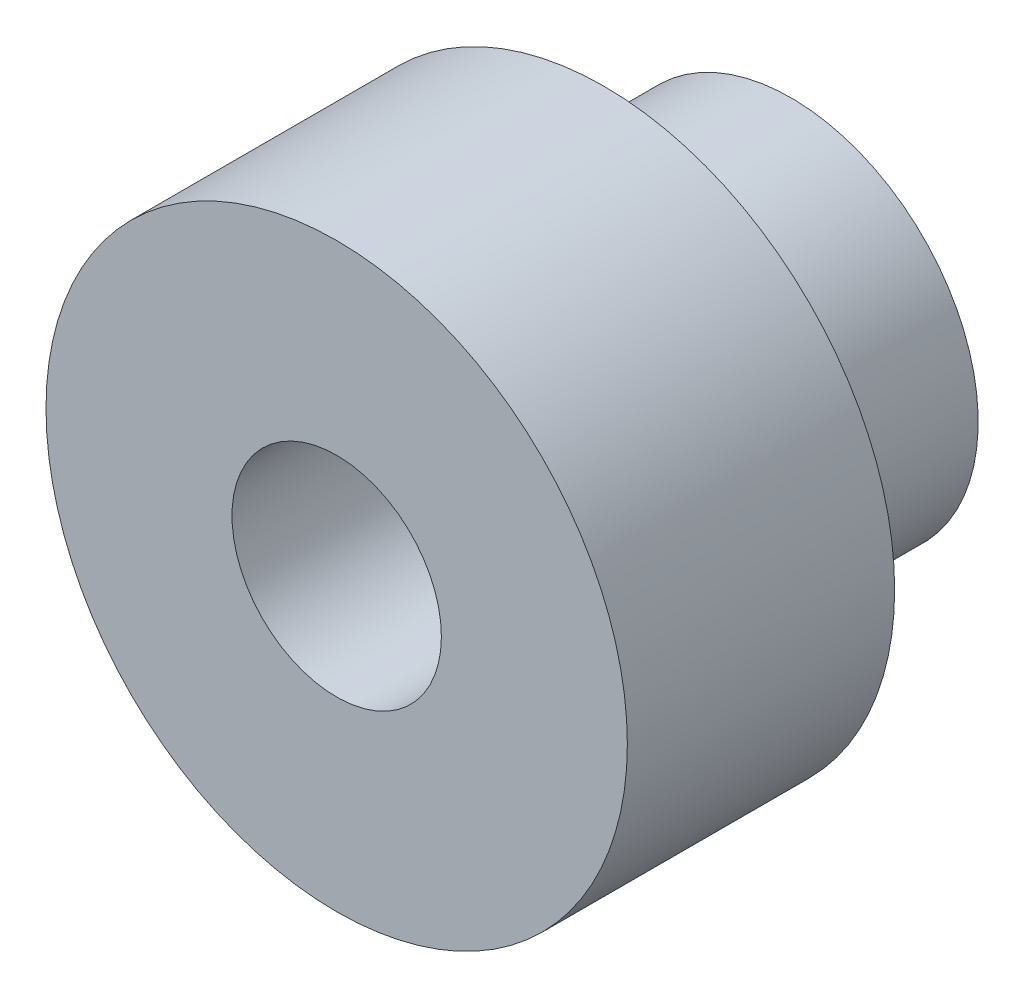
ISO-10303-21;
HEADER;
FILE_DESCRIPTION(('STEP AP214'),'2;1');
FILE_NAME('part.step','',(''),(''),'','','');
FILE_SCHEMA(('AUTOMOTIVE_DESIGN { 1 0 10303 214 1 1 1 1 }'));
ENDSEC;
DATA;
#1=APPLICATION_CONTEXT('core data for automotive mechanical design processes');
#2=APPLICATION_PROTOCOL_DEFINITION('international standard','automotive_design',2000,#1);
#3=PRODUCT_CONTEXT('',#1,'mechanical');
#4=PRODUCT('Part','Part','',(#3));
#5=PRODUCT_RELATED_PRODUCT_CATEGORY('part','',(#4));
#6=PRODUCT_DEFINITION_FORMATION('','',#4);
#7=PRODUCT_DEFINITION_CONTEXT('part definition',#1,'design');
#8=PRODUCT_DEFINITION('design','',#6,#7);
#9=PRODUCT_DEFINITION_SHAPE('','',#8);
#10=(LENGTH_UNIT() NAMED_UNIT(*) SI_UNIT(.MILLI.,.METRE.));
#11=(NAMED_UNIT(*) PLANE_ANGLE_UNIT() SI_UNIT($,.RADIAN.));
#12=(NAMED_UNIT(*) SI_UNIT($,.STERADIAN.) SOLID_ANGLE_UNIT());
#13=UNCERTAINTY_MEASURE_WITH_UNIT(LENGTH_MEASURE(1.E-05),#10,'distance_accuracy_value','');
#14=(GEOMETRIC_REPRESENTATION_CONTEXT(3) GLOBAL_UNCERTAINTY_ASSIGNED_CONTEXT((#13)) GLOBAL_UNIT_ASSIGNED_CONTEXT((#10,
#11,#12)) REPRESENTATION_CONTEXT('',''));
#15=CARTESIAN_POINT('',(0.,0.,0.));
#16=DIRECTION('',(0.,0.,1.));
#17=DIRECTION('',(1.,0.,0.));
#18=AXIS2_PLACEMENT_3D('',#15,#16,#17);
#19=CARTESIAN_POINT('',(0.,0.,-3.628869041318));
#20=DIRECTION('',(0.,0.,-1.));
#21=DIRECTION('',(1.,0.,0.));
#22=AXIS2_PLACEMENT_3D('',#19,#20,#21);
#23=CYLINDRICAL_SURFACE('',#22,0.7835);
#24=CARTESIAN_POINT('',(0.7835,0.,3.4));
#25=CARTESIAN_POINT('',(0.7835,0.,0.));
#26=(BOUNDED_CURVE() B_SPLINE_CURVE(1,(#24,#25),.UNSPECIFIED.,.F.,
.F.) B_SPLINE_CURVE_WITH_KNOTS((2,2),(-7.028869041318,-3.628869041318),
.UNSPECIFIED.) CURVE() GEOMETRIC_REPRESENTATION_ITEM() RATIONAL_B_SPLINE_CURVE((1.,1.)) REPRESENTATION_ITEM(''));
#27=CARTESIAN_POINT('',(0.7835,0.,3.4));
#28=VERTEX_POINT('',#27);
#29=CARTESIAN_POINT('',(0.7835,0.,0.));
#30=VERTEX_POINT('',#29);
#31=EDGE_CURVE('E11',#28,#30,#26,.T.);
#32=ORIENTED_EDGE('',*,*,#31,.F.);
#33=CARTESIAN_POINT('',(0.,0.,3.4));
#34=DIRECTION('',(0.,0.,1.));
#35=DIRECTION('',(1.,0.,0.));
#36=AXIS2_PLACEMENT_3D('',#33,#34,#35);
#37=CIRCLE('',#36,0.7835);
#38=EDGE_CURVE('E62',#28,#28,#37,.T.);
#39=ORIENTED_EDGE('',*,*,#38,.T.);
#40=ORIENTED_EDGE('',*,*,#31,.T.);
#41=CARTESIAN_POINT('',(0.,0.,0.));
#42=DIRECTION('',(0.,0.,1.));
#43=DIRECTION('',(1.,0.,0.));
#44=AXIS2_PLACEMENT_3D('',#41,#42,#43);
#45=CIRCLE('',#44,0.7835);
#46=EDGE_CURVE('E64',#30,#30,#45,.T.);
#47=ORIENTED_EDGE('',*,*,#46,.F.);
#48=EDGE_LOOP('',(#32,#39,#40,#47));
#49=FACE_BOUND('',#48,.T.);
#50=ADVANCED_FACE('F17',(#49),#23,.F.);
#51=CARTESIAN_POINT('',(0.,0.,0.));
#52=DIRECTION('',(0.,0.,1.));
#53=DIRECTION('',(-1.,0.,0.));
#54=AXIS2_PLACEMENT_3D('',#51,#52,#53);
#55=CYLINDRICAL_SURFACE('',#54,1.4);
#56=CARTESIAN_POINT('',(0.,0.,0.));
#57=DIRECTION('',(0.,0.,-1.));
#58=DIRECTION('',(-1.,0.,0.));
#59=AXIS2_PLACEMENT_3D('',#56,#57,#58);
#60=CIRCLE('',#59,1.4);
#61=CARTESIAN_POINT('',(-1.4,0.,0.));
#62=VERTEX_POINT('',#61);
#63=EDGE_CURVE('E68',#62,#62,#60,.T.);
#64=ORIENTED_EDGE('',*,*,#63,.F.);
#65=CARTESIAN_POINT('',(-1.4,0.,0.));
#66=CARTESIAN_POINT('',(-1.4,0.,1.4));
#67=(BOUNDED_CURVE() B_SPLINE_CURVE(1,(#65,#66),.UNSPECIFIED.,.F.,
.F.) B_SPLINE_CURVE_WITH_KNOTS((2,2),(0.,1.4),
.UNSPECIFIED.) CURVE() GEOMETRIC_REPRESENTATION_ITEM() RATIONAL_B_SPLINE_CURVE((1.,1.)) REPRESENTATION_ITEM(''));
#68=CARTESIAN_POINT('',(-1.4,0.,1.4));
#69=VERTEX_POINT('',#68);
#70=EDGE_CURVE('E27',#62,#69,#67,.T.);
#71=ORIENTED_EDGE('',*,*,#70,.T.);
#72=CARTESIAN_POINT('',(0.,0.,1.4));
#73=DIRECTION('',(0.,0.,-1.));
#74=DIRECTION('',(-1.,0.,0.));
#75=AXIS2_PLACEMENT_3D('',#72,#73,#74);
#76=CIRCLE('',#75,1.4);
#77=EDGE_CURVE('E75',#69,#69,#76,.T.);
#78=ORIENTED_EDGE('',*,*,#77,.T.);
#79=ORIENTED_EDGE('',*,*,#70,.F.);
#80=EDGE_LOOP('',(#64,#71,#78,#79));
#81=FACE_BOUND('',#80,.T.);
#82=ADVANCED_FACE('F91',(#81),#55,.T.);
#83=CARTESIAN_POINT('',(-2.175,0.,1.4));
#84=DIRECTION('',(0.,0.,1.));
#85=DIRECTION('',(1.,0.,0.));
#86=AXIS2_PLACEMENT_3D('',#83,#84,#85);
#87=PLANE('',#86);
#88=CARTESIAN_POINT('',(0.,0.,1.4));
#89=DIRECTION('',(0.,0.,-1.));
#90=DIRECTION('',(-1.,0.,0.));
#91=AXIS2_PLACEMENT_3D('',#88,#89,#90);
#92=CIRCLE('',#91,2.175);
#93=CARTESIAN_POINT('',(-2.175,0.,1.4));
#94=VERTEX_POINT('',#93);
#95=EDGE_CURVE('E77',#94,#94,#92,.T.);
#96=ORIENTED_EDGE('',*,*,#95,.T.);
#97=EDGE_LOOP('',(#96));
#98=FACE_BOUND('',#97,.T.);
#99=ORIENTED_EDGE('',*,*,#77,.F.);
#100=EDGE_LOOP('',(#99));
#101=FACE_BOUND('',#100,.T.);
#102=ADVANCED_FACE('F93',(#98,#101),#87,.F.);
#103=CARTESIAN_POINT('',(-1.4,0.,0.));
#104=DIRECTION('',(0.,0.,1.));
#105=DIRECTION('',(1.,0.,0.));
#106=AXIS2_PLACEMENT_3D('',#103,#104,#105);
#107=PLANE('',#106);
#108=ORIENTED_EDGE('',*,*,#63,.T.);
#109=EDGE_LOOP('',(#108));
#110=FACE_BOUND('',#109,.T.);
#111=ORIENTED_EDGE('',*,*,#46,.T.);
#112=EDGE_LOOP('',(#111));
#113=FACE_BOUND('',#112,.T.);
#114=ADVANCED_FACE('F66',(#110,#113),#107,.F.);
#115=CARTESIAN_POINT('',(0.,0.,0.));
#116=DIRECTION('',(0.,0.,1.));
#117=DIRECTION('',(-1.,0.,0.));
#118=AXIS2_PLACEMENT_3D('',#115,#116,#117);
#119=CYLINDRICAL_SURFACE('',#118,2.175);
#120=ORIENTED_EDGE('',*,*,#95,.F.);
#121=CARTESIAN_POINT('',(-2.175,0.,1.4));
#122=CARTESIAN_POINT('',(-2.175,0.,3.4));
#123=(BOUNDED_CURVE() B_SPLINE_CURVE(1,(#121,#122),.UNSPECIFIED.,.F.,
.F.) B_SPLINE_CURVE_WITH_KNOTS((2,2),(1.4,3.4),
.UNSPECIFIED.) CURVE() GEOMETRIC_REPRESENTATION_ITEM() RATIONAL_B_SPLINE_CURVE((1.,1.)) REPRESENTATION_ITEM(''));
#124=CARTESIAN_POINT('',(-2.175,0.,3.4));
#125=VERTEX_POINT('',#124);
#126=EDGE_CURVE('E69',#94,#125,#123,.T.);
#127=ORIENTED_EDGE('',*,*,#126,.T.);
#128=CARTESIAN_POINT('',(0.,0.,3.4));
#129=DIRECTION('',(0.,0.,-1.));
#130=DIRECTION('',(-1.,0.,0.));
#131=AXIS2_PLACEMENT_3D('',#128,#129,#130);
#132=CIRCLE('',#131,2.175);
#133=EDGE_CURVE('E234',#125,#125,#132,.T.);
#134=ORIENTED_EDGE('',*,*,#133,.T.);
#135=ORIENTED_EDGE('',*,*,#126,.F.);
#136=EDGE_LOOP('',(#120,#127,#134,#135));
#137=FACE_BOUND('',#136,.T.);
#138=ADVANCED_FACE('F102',(#137),#119,.T.);
#139=CARTESIAN_POINT('',(0.,0.,3.4));
#140=DIRECTION('',(0.,0.,-1.));
#141=DIRECTION('',(0.,-1.,0.));
#142=AXIS2_PLACEMENT_3D('',#139,#140,#141);
#143=PLANE('',#142);
#144=ORIENTED_EDGE('',*,*,#133,.F.);
#145=EDGE_LOOP('',(#144));
#146=FACE_BOUND('',#145,.T.);
#147=ORIENTED_EDGE('',*,*,#38,.F.);
#148=EDGE_LOOP('',(#147));
#149=FACE_BOUND('',#148,.T.);
#150=ADVANCED_FACE('F212',(#146,#149),#143,.F.);
#151=CLOSED_SHELL('',(#50,#82,#102,#114,#138,#150));
#152=MANIFOLD_SOLID_BREP('B1',#151);
#153=ADVANCED_BREP_SHAPE_REPRESENTATION('',(#18,#152),#14);
#154=SHAPE_DEFINITION_REPRESENTATION(#9,#153);
ENDSEC;
END-ISO-10303-21;
